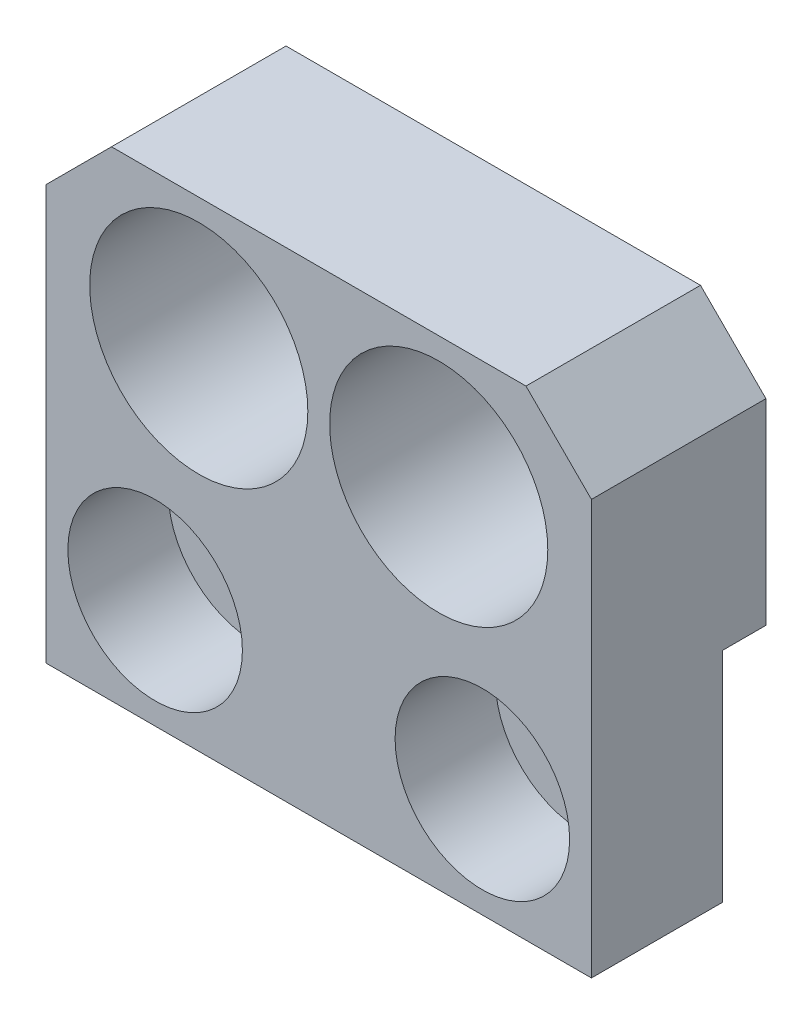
ISO-10303-21;
HEADER;
FILE_DESCRIPTION(('STEP AP214'),'2;1');
FILE_NAME('part.step','',(''),(''),'','','');
FILE_SCHEMA(('AUTOMOTIVE_DESIGN { 1 0 10303 214 1 1 1 1 }'));
ENDSEC;
DATA;
#1=APPLICATION_CONTEXT('core data for automotive mechanical design processes');
#2=APPLICATION_PROTOCOL_DEFINITION('international standard','automotive_design',2000,#1);
#3=PRODUCT_CONTEXT('',#1,'mechanical');
#4=PRODUCT('Part','Part','',(#3));
#5=PRODUCT_RELATED_PRODUCT_CATEGORY('part','',(#4));
#6=PRODUCT_DEFINITION_FORMATION('','',#4);
#7=PRODUCT_DEFINITION_CONTEXT('part definition',#1,'design');
#8=PRODUCT_DEFINITION('design','',#6,#7);
#9=PRODUCT_DEFINITION_SHAPE('','',#8);
#10=(LENGTH_UNIT() NAMED_UNIT(*) SI_UNIT(.MILLI.,.METRE.));
#11=(NAMED_UNIT(*) PLANE_ANGLE_UNIT() SI_UNIT($,.RADIAN.));
#12=(NAMED_UNIT(*) SI_UNIT($,.STERADIAN.) SOLID_ANGLE_UNIT());
#13=UNCERTAINTY_MEASURE_WITH_UNIT(LENGTH_MEASURE(1.E-05),#10,'distance_accuracy_value','');
#14=(GEOMETRIC_REPRESENTATION_CONTEXT(3) GLOBAL_UNCERTAINTY_ASSIGNED_CONTEXT((#13)) GLOBAL_UNIT_ASSIGNED_CONTEXT((#10,
#11,#12)) REPRESENTATION_CONTEXT('',''));
#15=CARTESIAN_POINT('',(0.,0.,0.));
#16=DIRECTION('',(0.,0.,1.));
#17=DIRECTION('',(1.,0.,0.));
#18=AXIS2_PLACEMENT_3D('',#15,#16,#17);
#19=CARTESIAN_POINT('',(0.,-94.7630029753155,8.));
#20=DIRECTION('',(1.,0.,0.));
#21=DIRECTION('',(0.,0.,-1.));
#22=AXIS2_PLACEMENT_3D('',#19,#20,#21);
#23=PLANE('',#22);
#24=DIRECTION('',(0.,-1.,0.));
#25=VECTOR('',#24,1.);
#26=CARTESIAN_POINT('',(0.,-94.7630029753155,8.));
#27=LINE('',#26,#25);
#28=CARTESIAN_POINT('',(0.,-75.7630029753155,8.));
#29=VERTEX_POINT('',#28);
#30=CARTESIAN_POINT('',(0.,-94.7630029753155,8.));
#31=VERTEX_POINT('',#30);
#32=EDGE_CURVE('E131',#29,#31,#27,.T.);
#33=ORIENTED_EDGE('',*,*,#32,.F.);
#34=DIRECTION('',(0.,0.,-1.));
#35=VECTOR('',#34,1.);
#36=CARTESIAN_POINT('',(0.,-75.7630029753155,8.));
#37=LINE('',#36,#35);
#38=CARTESIAN_POINT('',(0.,-75.7630029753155,0.));
#39=VERTEX_POINT('',#38);
#40=EDGE_CURVE('E149',#29,#39,#37,.T.);
#41=ORIENTED_EDGE('',*,*,#40,.T.);
#42=DIRECTION('',(0.,-1.,0.));
#43=VECTOR('',#42,1.);
#44=CARTESIAN_POINT('',(0.,-94.7630029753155,0.));
#45=LINE('',#44,#43);
#46=CARTESIAN_POINT('',(0.,-84.7630029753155,0.));
#47=VERTEX_POINT('',#46);
#48=EDGE_CURVE('E107',#39,#47,#45,.T.);
#49=ORIENTED_EDGE('',*,*,#48,.T.);
#50=DIRECTION('',(0.,0.,1.));
#51=VECTOR('',#50,1.);
#52=CARTESIAN_POINT('',(0.,-84.7630029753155,0.));
#53=LINE('',#52,#51);
#54=CARTESIAN_POINT('',(0.,-84.7630029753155,2.));
#55=VERTEX_POINT('',#54);
#56=EDGE_CURVE('E87',#47,#55,#53,.T.);
#57=ORIENTED_EDGE('',*,*,#56,.T.);
#58=DIRECTION('',(0.,-1.,0.));
#59=VECTOR('',#58,1.);
#60=CARTESIAN_POINT('',(0.,-94.7630029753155,2.));
#61=LINE('',#60,#59);
#62=CARTESIAN_POINT('',(0.,-94.7630029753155,2.));
#63=VERTEX_POINT('',#62);
#64=EDGE_CURVE('E97',#55,#63,#61,.T.);
#65=ORIENTED_EDGE('',*,*,#64,.T.);
#66=DIRECTION('',(0.,0.,-1.));
#67=VECTOR('',#66,1.);
#68=CARTESIAN_POINT('',(0.,-94.7630029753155,8.));
#69=LINE('',#68,#67);
#70=EDGE_CURVE('E147',#31,#63,#69,.T.);
#71=ORIENTED_EDGE('',*,*,#70,.F.);
#72=EDGE_LOOP('',(#33,#41,#49,#57,#65,#71));
#73=FACE_BOUND('',#72,.T.);
#74=ADVANCED_FACE('F16',(#73),#23,.F.);
#75=CARTESIAN_POINT('',(0.,-94.7630029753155,8.));
#76=DIRECTION('',(0.,1.,0.));
#77=DIRECTION('',(0.,0.,1.));
#78=AXIS2_PLACEMENT_3D('',#75,#76,#77);
#79=PLANE('',#78);
#80=ORIENTED_EDGE('',*,*,#70,.T.);
#81=DIRECTION('',(1.,0.,0.));
#82=VECTOR('',#81,1.);
#83=CARTESIAN_POINT('',(0.,-94.7630029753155,2.));
#84=LINE('',#83,#82);
#85=CARTESIAN_POINT('',(25.,-94.7630029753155,2.));
#86=VERTEX_POINT('',#85);
#87=EDGE_CURVE('E93',#63,#86,#84,.T.);
#88=ORIENTED_EDGE('',*,*,#87,.T.);
#89=DIRECTION('',(0.,0.,-1.));
#90=VECTOR('',#89,1.);
#91=CARTESIAN_POINT('',(25.,-94.7630029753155,8.));
#92=LINE('',#91,#90);
#93=CARTESIAN_POINT('',(25.,-94.7630029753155,8.));
#94=VERTEX_POINT('',#93);
#95=EDGE_CURVE('E140',#94,#86,#92,.T.);
#96=ORIENTED_EDGE('',*,*,#95,.F.);
#97=DIRECTION('',(1.,0.,0.));
#98=VECTOR('',#97,1.);
#99=CARTESIAN_POINT('',(0.,-94.7630029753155,8.));
#100=LINE('',#99,#98);
#101=EDGE_CURVE('E133',#31,#94,#100,.T.);
#102=ORIENTED_EDGE('',*,*,#101,.F.);
#103=EDGE_LOOP('',(#80,#88,#96,#102));
#104=FACE_BOUND('',#103,.T.);
#105=ADVANCED_FACE('F186',(#104),#79,.F.);
#106=CARTESIAN_POINT('',(25.,-94.7630029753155,8.));
#107=DIRECTION('',(-1.,0.,0.));
#108=DIRECTION('',(0.,0.,1.));
#109=AXIS2_PLACEMENT_3D('',#106,#107,#108);
#110=PLANE('',#109);
#111=DIRECTION('',(0.,1.,0.));
#112=VECTOR('',#111,1.);
#113=CARTESIAN_POINT('',(25.,-94.7630029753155,0.));
#114=LINE('',#113,#112);
#115=CARTESIAN_POINT('',(25.,-84.7630029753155,0.));
#116=VERTEX_POINT('',#115);
#117=CARTESIAN_POINT('',(25.,-75.7630029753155,0.));
#118=VERTEX_POINT('',#117);
#119=EDGE_CURVE('E142',#116,#118,#114,.T.);
#120=ORIENTED_EDGE('',*,*,#119,.T.);
#121=DIRECTION('',(0.,0.,1.));
#122=VECTOR('',#121,1.);
#123=CARTESIAN_POINT('',(25.,-75.7630029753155,8.));
#124=LINE('',#123,#122);
#125=CARTESIAN_POINT('',(25.,-75.7630029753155,8.));
#126=VERTEX_POINT('',#125);
#127=EDGE_CURVE('E11',#118,#126,#124,.T.);
#128=ORIENTED_EDGE('',*,*,#127,.T.);
#129=DIRECTION('',(0.,1.,0.));
#130=VECTOR('',#129,1.);
#131=CARTESIAN_POINT('',(25.,-94.7630029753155,8.));
#132=LINE('',#131,#130);
#133=EDGE_CURVE('E136',#94,#126,#132,.T.);
#134=ORIENTED_EDGE('',*,*,#133,.F.);
#135=ORIENTED_EDGE('',*,*,#95,.T.);
#136=DIRECTION('',(0.,-1.,0.));
#137=VECTOR('',#136,1.);
#138=CARTESIAN_POINT('',(25.,-94.7630029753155,2.));
#139=LINE('',#138,#137);
#140=CARTESIAN_POINT('',(25.,-84.7630029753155,2.));
#141=VERTEX_POINT('',#140);
#142=EDGE_CURVE('E108',#141,#86,#139,.T.);
#143=ORIENTED_EDGE('',*,*,#142,.F.);
#144=DIRECTION('',(0.,0.,1.));
#145=VECTOR('',#144,1.);
#146=CARTESIAN_POINT('',(25.,-84.7630029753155,0.));
#147=LINE('',#146,#145);
#148=EDGE_CURVE('E90',#116,#141,#147,.T.);
#149=ORIENTED_EDGE('',*,*,#148,.F.);
#150=EDGE_LOOP('',(#120,#128,#134,#135,#143,#149));
#151=FACE_BOUND('',#150,.T.);
#152=ADVANCED_FACE('F183',(#151),#110,.F.);
#153=CARTESIAN_POINT('',(0.,-72.7630029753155,8.));
#154=DIRECTION('',(0.,-1.,0.));
#155=DIRECTION('',(0.,0.,-1.));
#156=AXIS2_PLACEMENT_3D('',#153,#154,#155);
#157=PLANE('',#156);
#158=DIRECTION('',(-1.,0.,0.));
#159=VECTOR('',#158,1.);
#160=CARTESIAN_POINT('',(0.,-72.7630029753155,0.));
#161=LINE('',#160,#159);
#162=CARTESIAN_POINT('',(22.,-72.7630029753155,0.));
#163=VERTEX_POINT('',#162);
#164=CARTESIAN_POINT('',(3.,-72.7630029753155,0.));
#165=VERTEX_POINT('',#164);
#166=EDGE_CURVE('E134',#163,#165,#161,.T.);
#167=ORIENTED_EDGE('',*,*,#166,.T.);
#168=DIRECTION('',(0.,0.,1.));
#169=VECTOR('',#168,1.);
#170=CARTESIAN_POINT('',(3.,-72.7630029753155,8.));
#171=LINE('',#170,#169);
#172=CARTESIAN_POINT('',(3.,-72.7630029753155,8.));
#173=VERTEX_POINT('',#172);
#174=EDGE_CURVE('E37',#165,#173,#171,.T.);
#175=ORIENTED_EDGE('',*,*,#174,.T.);
#176=DIRECTION('',(-1.,0.,0.));
#177=VECTOR('',#176,1.);
#178=CARTESIAN_POINT('',(0.,-72.7630029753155,8.));
#179=LINE('',#178,#177);
#180=CARTESIAN_POINT('',(22.,-72.7630029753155,8.));
#181=VERTEX_POINT('',#180);
#182=EDGE_CURVE('E138',#181,#173,#179,.T.);
#183=ORIENTED_EDGE('',*,*,#182,.F.);
#184=DIRECTION('',(0.,0.,-1.));
#185=VECTOR('',#184,1.);
#186=CARTESIAN_POINT('',(22.,-72.7630029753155,8.));
#187=LINE('',#186,#185);
#188=EDGE_CURVE('E162',#181,#163,#187,.T.);
#189=ORIENTED_EDGE('',*,*,#188,.T.);
#190=EDGE_LOOP('',(#167,#175,#183,#189));
#191=FACE_BOUND('',#190,.T.);
#192=ADVANCED_FACE('F178',(#191),#157,.F.);
#193=CARTESIAN_POINT('',(0.,0.,8.));
#194=DIRECTION('',(0.,0.,-1.));
#195=DIRECTION('',(-1.,0.,0.));
#196=AXIS2_PLACEMENT_3D('',#193,#194,#195);
#197=PLANE('',#196);
#198=CARTESIAN_POINT('',(5.,-89.7630029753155,8.));
#199=DIRECTION('',(0.,0.,1.));
#200=DIRECTION('',(1.,0.,0.));
#201=AXIS2_PLACEMENT_3D('',#198,#199,#200);
#202=CIRCLE('',#201,4.);
#203=CARTESIAN_POINT('',(9.,-89.7630029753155,8.));
#204=VERTEX_POINT('',#203);
#205=EDGE_CURVE('E360',#204,#204,#202,.T.);
#206=ORIENTED_EDGE('',*,*,#205,.F.);
#207=EDGE_LOOP('',(#206));
#208=FACE_BOUND('',#207,.T.);
#209=CARTESIAN_POINT('',(20.,-89.7630029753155,8.));
#210=DIRECTION('',(0.,0.,1.));
#211=DIRECTION('',(1.,0.,0.));
#212=AXIS2_PLACEMENT_3D('',#209,#210,#211);
#213=CIRCLE('',#212,4.);
#214=CARTESIAN_POINT('',(24.,-89.7630029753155,8.));
#215=VERTEX_POINT('',#214);
#216=EDGE_CURVE('E155',#215,#215,#213,.T.);
#217=ORIENTED_EDGE('',*,*,#216,.F.);
#218=EDGE_LOOP('',(#217));
#219=FACE_BOUND('',#218,.T.);
#220=CARTESIAN_POINT('',(18.,-78.7630029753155,8.));
#221=DIRECTION('',(0.,0.,1.));
#222=DIRECTION('',(1.,0.,0.));
#223=AXIS2_PLACEMENT_3D('',#220,#221,#222);
#224=CIRCLE('',#223,5.);
#225=CARTESIAN_POINT('',(23.,-78.7630029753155,8.));
#226=VERTEX_POINT('',#225);
#227=EDGE_CURVE('E117',#226,#226,#224,.T.);
#228=ORIENTED_EDGE('',*,*,#227,.F.);
#229=EDGE_LOOP('',(#228));
#230=FACE_BOUND('',#229,.T.);
#231=CARTESIAN_POINT('',(7.,-78.7630029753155,8.));
#232=DIRECTION('',(0.,0.,1.));
#233=DIRECTION('',(1.,0.,0.));
#234=AXIS2_PLACEMENT_3D('',#231,#232,#233);
#235=CIRCLE('',#234,5.);
#236=CARTESIAN_POINT('',(12.,-78.7630029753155,8.));
#237=VERTEX_POINT('',#236);
#238=EDGE_CURVE('E123',#237,#237,#235,.T.);
#239=ORIENTED_EDGE('',*,*,#238,.F.);
#240=EDGE_LOOP('',(#239));
#241=FACE_BOUND('',#240,.T.);
#242=ORIENTED_EDGE('',*,*,#182,.T.);
#243=DIRECTION('',(0.70710678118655,0.707106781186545,0.));
#244=VECTOR('',#243,1.);
#245=CARTESIAN_POINT('',(0.,-75.7630029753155,8.));
#246=LINE('',#245,#244);
#247=EDGE_CURVE('E24',#173,#29,#246,.F.);
#248=ORIENTED_EDGE('',*,*,#247,.T.);
#249=ORIENTED_EDGE('',*,*,#32,.T.);
#250=ORIENTED_EDGE('',*,*,#101,.T.);
#251=ORIENTED_EDGE('',*,*,#133,.T.);
#252=DIRECTION('',(0.707106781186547,-0.707106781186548,0.));
#253=VECTOR('',#252,1.);
#254=CARTESIAN_POINT('',(22.,-72.7630029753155,8.));
#255=LINE('',#254,#253);
#256=EDGE_CURVE('E166',#126,#181,#255,.F.);
#257=ORIENTED_EDGE('',*,*,#256,.T.);
#258=EDGE_LOOP('',(#242,#248,#249,#250,#251,#257));
#259=FACE_BOUND('',#258,.T.);
#260=ADVANCED_FACE('F169',(#208,#219,#230,#241,#259),#197,.F.);
#261=CARTESIAN_POINT('',(0.,0.,0.));
#262=DIRECTION('',(0.,0.,-1.));
#263=DIRECTION('',(-1.,0.,0.));
#264=AXIS2_PLACEMENT_3D('',#261,#262,#263);
#265=PLANE('',#264);
#266=ORIENTED_EDGE('',*,*,#48,.F.);
#267=DIRECTION('',(-0.70710678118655,-0.707106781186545,0.));
#268=VECTOR('',#267,1.);
#269=CARTESIAN_POINT('',(37.8815014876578,-37.881501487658,0.));
#270=LINE('',#269,#268);
#271=EDGE_CURVE('E160',#39,#165,#270,.F.);
#272=ORIENTED_EDGE('',*,*,#271,.T.);
#273=ORIENTED_EDGE('',*,*,#166,.F.);
#274=DIRECTION('',(-0.707106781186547,0.707106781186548,0.));
#275=VECTOR('',#274,1.);
#276=CARTESIAN_POINT('',(-25.3815014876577,-25.3815014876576,0.));
#277=LINE('',#276,#275);
#278=EDGE_CURVE('E158',#163,#118,#277,.F.);
#279=ORIENTED_EDGE('',*,*,#278,.T.);
#280=ORIENTED_EDGE('',*,*,#119,.F.);
#281=DIRECTION('',(1.,0.,0.));
#282=VECTOR('',#281,1.);
#283=CARTESIAN_POINT('',(0.,-84.7630029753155,0.));
#284=LINE('',#283,#282);
#285=EDGE_CURVE('E94',#47,#116,#284,.T.);
#286=ORIENTED_EDGE('',*,*,#285,.F.);
#287=EDGE_LOOP('',(#266,#272,#273,#279,#280,#286));
#288=FACE_BOUND('',#287,.T.);
#289=CARTESIAN_POINT('',(18.,-78.7630029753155,0.));
#290=DIRECTION('',(0.,0.,1.));
#291=DIRECTION('',(1.,0.,0.));
#292=AXIS2_PLACEMENT_3D('',#289,#290,#291);
#293=CIRCLE('',#292,5.);
#294=CARTESIAN_POINT('',(23.,-78.7630029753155,0.));
#295=VERTEX_POINT('',#294);
#296=EDGE_CURVE('E120',#295,#295,#293,.T.);
#297=ORIENTED_EDGE('',*,*,#296,.T.);
#298=EDGE_LOOP('',(#297));
#299=FACE_BOUND('',#298,.T.);
#300=CARTESIAN_POINT('',(7.,-78.7630029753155,0.));
#301=DIRECTION('',(0.,0.,1.));
#302=DIRECTION('',(1.,0.,0.));
#303=AXIS2_PLACEMENT_3D('',#300,#301,#302);
#304=CIRCLE('',#303,5.);
#305=CARTESIAN_POINT('',(12.,-78.7630029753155,0.));
#306=VERTEX_POINT('',#305);
#307=EDGE_CURVE('E126',#306,#306,#304,.T.);
#308=ORIENTED_EDGE('',*,*,#307,.T.);
#309=EDGE_LOOP('',(#308));
#310=FACE_BOUND('',#309,.T.);
#311=ADVANCED_FACE('F176',(#288,#299,#310),#265,.T.);
#312=CARTESIAN_POINT('',(7.,-78.7630029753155,0.));
#313=DIRECTION('',(0.,0.,1.));
#314=DIRECTION('',(1.,0.,0.));
#315=AXIS2_PLACEMENT_3D('',#312,#313,#314);
#316=CYLINDRICAL_SURFACE('',#315,5.);
#317=ORIENTED_EDGE('',*,*,#307,.F.);
#318=EDGE_LOOP('',(#317));
#319=FACE_BOUND('',#318,.T.);
#320=ORIENTED_EDGE('',*,*,#238,.T.);
#321=EDGE_LOOP('',(#320));
#322=FACE_BOUND('',#321,.T.);
#323=ADVANCED_FACE('F241',(#319,#322),#316,.F.);
#324=CARTESIAN_POINT('',(18.,-78.7630029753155,0.));
#325=DIRECTION('',(0.,0.,1.));
#326=DIRECTION('',(1.,0.,0.));
#327=AXIS2_PLACEMENT_3D('',#324,#325,#326);
#328=CYLINDRICAL_SURFACE('',#327,5.);
#329=ORIENTED_EDGE('',*,*,#296,.F.);
#330=EDGE_LOOP('',(#329));
#331=FACE_BOUND('',#330,.T.);
#332=ORIENTED_EDGE('',*,*,#227,.T.);
#333=EDGE_LOOP('',(#332));
#334=FACE_BOUND('',#333,.T.);
#335=ADVANCED_FACE('F235',(#331,#334),#328,.F.);
#336=CARTESIAN_POINT('',(0.,-94.7630029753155,2.));
#337=DIRECTION('',(0.,0.,1.));
#338=DIRECTION('',(1.,0.,0.));
#339=AXIS2_PLACEMENT_3D('',#336,#337,#338);
#340=PLANE('',#339);
#341=CARTESIAN_POINT('',(5.,-89.7630029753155,2.));
#342=DIRECTION('',(0.,0.,1.));
#343=DIRECTION('',(1.,0.,0.));
#344=AXIS2_PLACEMENT_3D('',#341,#342,#343);
#345=CIRCLE('',#344,2.25);
#346=CARTESIAN_POINT('',(7.25,-89.7630029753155,2.));
#347=VERTEX_POINT('',#346);
#348=EDGE_CURVE('E152',#347,#347,#345,.T.);
#349=ORIENTED_EDGE('',*,*,#348,.T.);
#350=EDGE_LOOP('',(#349));
#351=FACE_BOUND('',#350,.T.);
#352=CARTESIAN_POINT('',(20.,-89.7630029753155,2.));
#353=DIRECTION('',(0.,0.,1.));
#354=DIRECTION('',(1.,0.,0.));
#355=AXIS2_PLACEMENT_3D('',#352,#353,#354);
#356=CIRCLE('',#355,2.25);
#357=CARTESIAN_POINT('',(22.25,-89.7630029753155,2.));
#358=VERTEX_POINT('',#357);
#359=EDGE_CURVE('E115',#358,#358,#356,.T.);
#360=ORIENTED_EDGE('',*,*,#359,.T.);
#361=EDGE_LOOP('',(#360));
#362=FACE_BOUND('',#361,.T.);
#363=ORIENTED_EDGE('',*,*,#142,.T.);
#364=ORIENTED_EDGE('',*,*,#87,.F.);
#365=ORIENTED_EDGE('',*,*,#64,.F.);
#366=DIRECTION('',(1.,0.,0.));
#367=VECTOR('',#366,1.);
#368=CARTESIAN_POINT('',(0.,-84.7630029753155,2.));
#369=LINE('',#368,#367);
#370=EDGE_CURVE('E83',#55,#141,#369,.T.);
#371=ORIENTED_EDGE('',*,*,#370,.T.);
#372=EDGE_LOOP('',(#363,#364,#365,#371));
#373=FACE_BOUND('',#372,.T.);
#374=ADVANCED_FACE('F98',(#351,#362,#373),#340,.F.);
#375=CARTESIAN_POINT('',(0.,-84.7630029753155,0.));
#376=DIRECTION('',(0.,1.,0.));
#377=DIRECTION('',(0.,0.,1.));
#378=AXIS2_PLACEMENT_3D('',#375,#376,#377);
#379=PLANE('',#378);
#380=ORIENTED_EDGE('',*,*,#148,.T.);
#381=ORIENTED_EDGE('',*,*,#370,.F.);
#382=ORIENTED_EDGE('',*,*,#56,.F.);
#383=ORIENTED_EDGE('',*,*,#285,.T.);
#384=EDGE_LOOP('',(#380,#381,#382,#383));
#385=FACE_BOUND('',#384,.T.);
#386=ADVANCED_FACE('F85',(#385),#379,.F.);
#387=CARTESIAN_POINT('',(20.,-89.7630029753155,8.));
#388=DIRECTION('',(0.,0.,1.));
#389=DIRECTION('',(1.,0.,0.));
#390=AXIS2_PLACEMENT_3D('',#387,#388,#389);
#391=CYLINDRICAL_SURFACE('',#390,2.25);
#392=CARTESIAN_POINT('',(20.,-89.7630029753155,3.4));
#393=DIRECTION('',(0.,0.,1.));
#394=DIRECTION('',(1.,0.,0.));
#395=AXIS2_PLACEMENT_3D('',#392,#393,#394);
#396=CIRCLE('',#395,2.25);
#397=CARTESIAN_POINT('',(22.25,-89.7630029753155,3.4));
#398=VERTEX_POINT('',#397);
#399=EDGE_CURVE('E112',#398,#398,#396,.T.);
#400=ORIENTED_EDGE('',*,*,#399,.T.);
#401=EDGE_LOOP('',(#400));
#402=FACE_BOUND('',#401,.T.);
#403=ORIENTED_EDGE('',*,*,#359,.F.);
#404=EDGE_LOOP('',(#403));
#405=FACE_BOUND('',#404,.T.);
#406=ADVANCED_FACE('F228',(#402,#405),#391,.F.);
#407=CARTESIAN_POINT('',(22.25,-89.7630029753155,3.4));
#408=DIRECTION('',(0.,0.,-1.));
#409=DIRECTION('',(-1.,0.,0.));
#410=AXIS2_PLACEMENT_3D('',#407,#408,#409);
#411=PLANE('',#410);
#412=ORIENTED_EDGE('',*,*,#399,.F.);
#413=EDGE_LOOP('',(#412));
#414=FACE_BOUND('',#413,.T.);
#415=CARTESIAN_POINT('',(20.,-89.7630029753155,3.4));
#416=DIRECTION('',(0.,0.,1.));
#417=DIRECTION('',(1.,0.,0.));
#418=AXIS2_PLACEMENT_3D('',#415,#416,#417);
#419=CIRCLE('',#418,4.);
#420=CARTESIAN_POINT('',(24.,-89.7630029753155,3.4));
#421=VERTEX_POINT('',#420);
#422=EDGE_CURVE('E370',#421,#421,#419,.T.);
#423=ORIENTED_EDGE('',*,*,#422,.T.);
#424=EDGE_LOOP('',(#423));
#425=FACE_BOUND('',#424,.T.);
#426=ADVANCED_FACE('F224',(#414,#425),#411,.F.);
#427=CARTESIAN_POINT('',(20.,-89.7630029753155,8.));
#428=DIRECTION('',(0.,0.,1.));
#429=DIRECTION('',(1.,0.,0.));
#430=AXIS2_PLACEMENT_3D('',#427,#428,#429);
#431=CYLINDRICAL_SURFACE('',#430,4.);
#432=ORIENTED_EDGE('',*,*,#422,.F.);
#433=EDGE_LOOP('',(#432));
#434=FACE_BOUND('',#433,.T.);
#435=ORIENTED_EDGE('',*,*,#216,.T.);
#436=EDGE_LOOP('',(#435));
#437=FACE_BOUND('',#436,.T.);
#438=ADVANCED_FACE('F220',(#434,#437),#431,.F.);
#439=CARTESIAN_POINT('',(5.,-89.7630029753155,8.));
#440=DIRECTION('',(0.,0.,1.));
#441=DIRECTION('',(1.,0.,0.));
#442=AXIS2_PLACEMENT_3D('',#439,#440,#441);
#443=CYLINDRICAL_SURFACE('',#442,2.25);
#444=CARTESIAN_POINT('',(5.,-89.7630029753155,3.4));
#445=DIRECTION('',(0.,0.,1.));
#446=DIRECTION('',(1.,0.,0.));
#447=AXIS2_PLACEMENT_3D('',#444,#445,#446);
#448=CIRCLE('',#447,2.25);
#449=CARTESIAN_POINT('',(7.25,-89.7630029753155,3.4));
#450=VERTEX_POINT('',#449);
#451=EDGE_CURVE('E156',#450,#450,#448,.T.);
#452=ORIENTED_EDGE('',*,*,#451,.T.);
#453=EDGE_LOOP('',(#452));
#454=FACE_BOUND('',#453,.T.);
#455=ORIENTED_EDGE('',*,*,#348,.F.);
#456=EDGE_LOOP('',(#455));
#457=FACE_BOUND('',#456,.T.);
#458=ADVANCED_FACE('F212',(#454,#457),#443,.F.);
#459=CARTESIAN_POINT('',(7.25,-89.7630029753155,3.4));
#460=DIRECTION('',(0.,0.,-1.));
#461=DIRECTION('',(-1.,0.,0.));
#462=AXIS2_PLACEMENT_3D('',#459,#460,#461);
#463=PLANE('',#462);
#464=ORIENTED_EDGE('',*,*,#451,.F.);
#465=EDGE_LOOP('',(#464));
#466=FACE_BOUND('',#465,.T.);
#467=CARTESIAN_POINT('',(5.,-89.7630029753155,3.4));
#468=DIRECTION('',(0.,0.,1.));
#469=DIRECTION('',(1.,0.,0.));
#470=AXIS2_PLACEMENT_3D('',#467,#468,#469);
#471=CIRCLE('',#470,4.);
#472=CARTESIAN_POINT('',(9.,-89.7630029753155,3.4));
#473=VERTEX_POINT('',#472);
#474=EDGE_CURVE('E376',#473,#473,#471,.T.);
#475=ORIENTED_EDGE('',*,*,#474,.T.);
#476=EDGE_LOOP('',(#475));
#477=FACE_BOUND('',#476,.T.);
#478=ADVANCED_FACE('F205',(#466,#477),#463,.F.);
#479=CARTESIAN_POINT('',(5.,-89.7630029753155,8.));
#480=DIRECTION('',(0.,0.,1.));
#481=DIRECTION('',(1.,0.,0.));
#482=AXIS2_PLACEMENT_3D('',#479,#480,#481);
#483=CYLINDRICAL_SURFACE('',#482,4.);
#484=ORIENTED_EDGE('',*,*,#474,.F.);
#485=EDGE_LOOP('',(#484));
#486=FACE_BOUND('',#485,.T.);
#487=ORIENTED_EDGE('',*,*,#205,.T.);
#488=EDGE_LOOP('',(#487));
#489=FACE_BOUND('',#488,.T.);
#490=ADVANCED_FACE('F199',(#486,#489),#483,.F.);
#491=CARTESIAN_POINT('',(0.,-75.7630029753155,8.));
#492=DIRECTION('',(0.707106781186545,-0.70710678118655,0.));
#493=DIRECTION('',(0.,0.,-1.));
#494=AXIS2_PLACEMENT_3D('',#491,#492,#493);
#495=PLANE('',#494);
#496=ORIENTED_EDGE('',*,*,#247,.F.);
#497=ORIENTED_EDGE('',*,*,#174,.F.);
#498=ORIENTED_EDGE('',*,*,#271,.F.);
#499=ORIENTED_EDGE('',*,*,#40,.F.);
#500=EDGE_LOOP('',(#496,#497,#498,#499));
#501=FACE_BOUND('',#500,.T.);
#502=ADVANCED_FACE('F173',(#501),#495,.F.);
#503=CARTESIAN_POINT('',(22.,-72.7630029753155,8.));
#504=DIRECTION('',(-0.707106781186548,-0.707106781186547,0.));
#505=DIRECTION('',(0.,0.,-1.));
#506=AXIS2_PLACEMENT_3D('',#503,#504,#505);
#507=PLANE('',#506);
#508=ORIENTED_EDGE('',*,*,#256,.F.);
#509=ORIENTED_EDGE('',*,*,#127,.F.);
#510=ORIENTED_EDGE('',*,*,#278,.F.);
#511=ORIENTED_EDGE('',*,*,#188,.F.);
#512=EDGE_LOOP('',(#508,#509,#510,#511));
#513=FACE_BOUND('',#512,.T.);
#514=ADVANCED_FACE('F18',(#513),#507,.F.);
#515=CLOSED_SHELL('',(#74,#105,#152,#192,#260,#311,#323,#335,#374,#386,#406,#426,#438,#458,#478,
#490,#502,#514));
#516=MANIFOLD_SOLID_BREP('B1',#515);
#517=ADVANCED_BREP_SHAPE_REPRESENTATION('',(#18,#516),#14);
#518=SHAPE_DEFINITION_REPRESENTATION(#9,#517);
ENDSEC;
END-ISO-10303-21;
